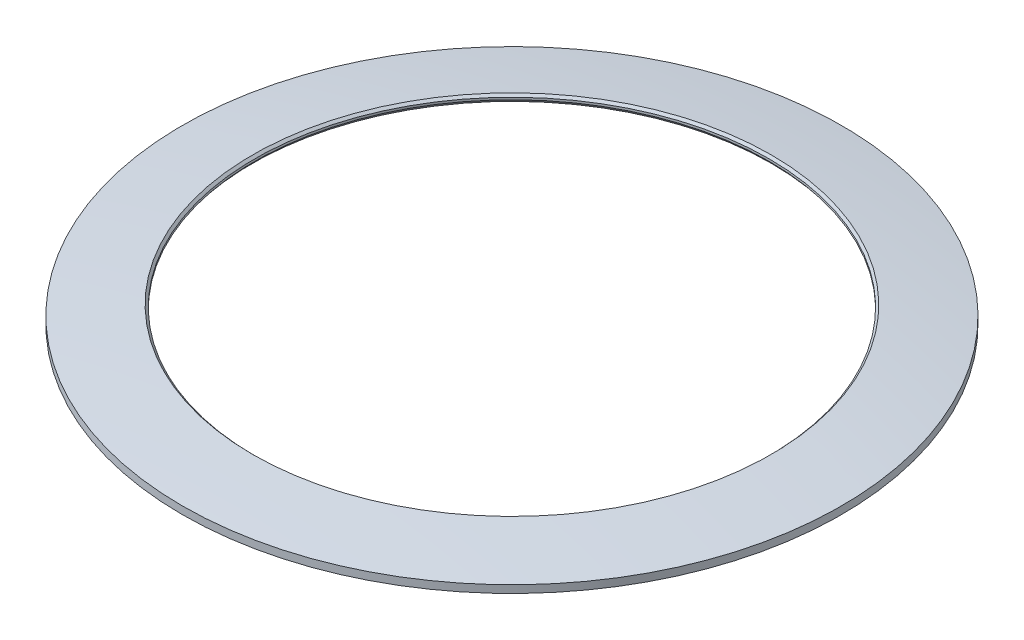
ISO-10303-21;
HEADER;
FILE_DESCRIPTION(('STEP AP214'),'2;1');
FILE_NAME('part.step','',(''),(''),'','','');
FILE_SCHEMA(('AUTOMOTIVE_DESIGN { 1 0 10303 214 1 1 1 1 }'));
ENDSEC;
DATA;
#1=APPLICATION_CONTEXT('core data for automotive mechanical design processes');
#2=APPLICATION_PROTOCOL_DEFINITION('international standard','automotive_design',2000,#1);
#3=PRODUCT_CONTEXT('',#1,'mechanical');
#4=PRODUCT('Part','Part','',(#3));
#5=PRODUCT_RELATED_PRODUCT_CATEGORY('part','',(#4));
#6=PRODUCT_DEFINITION_FORMATION('','',#4);
#7=PRODUCT_DEFINITION_CONTEXT('part definition',#1,'design');
#8=PRODUCT_DEFINITION('design','',#6,#7);
#9=PRODUCT_DEFINITION_SHAPE('','',#8);
#10=(LENGTH_UNIT() NAMED_UNIT(*) SI_UNIT(.MILLI.,.METRE.));
#11=(NAMED_UNIT(*) PLANE_ANGLE_UNIT() SI_UNIT($,.RADIAN.));
#12=(NAMED_UNIT(*) SI_UNIT($,.STERADIAN.) SOLID_ANGLE_UNIT());
#13=UNCERTAINTY_MEASURE_WITH_UNIT(LENGTH_MEASURE(1.E-05),#10,'distance_accuracy_value','');
#14=(GEOMETRIC_REPRESENTATION_CONTEXT(3) GLOBAL_UNCERTAINTY_ASSIGNED_CONTEXT((#13)) GLOBAL_UNIT_ASSIGNED_CONTEXT((#10,
#11,#12)) REPRESENTATION_CONTEXT('',''));
#15=CARTESIAN_POINT('',(0.,0.,0.));
#16=DIRECTION('',(0.,0.,1.));
#17=DIRECTION('',(1.,0.,0.));
#18=AXIS2_PLACEMENT_3D('',#15,#16,#17);
#19=CARTESIAN_POINT('',(2.62298239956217E-13,-355.6,0.));
#20=DIRECTION('',(0.,0.,1.));
#21=DIRECTION('',(-1.,0.,0.));
#22=AXIS2_PLACEMENT_3D('',#19,#20,#21);
#23=ELLIPSE('',#22,711.2,355.6);
#24=TRIMMED_CURVE('',#23,(PARAMETER_VALUE(1.5707963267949)),(PARAMETER_VALUE(4.71238898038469)),
.T.,.PARAMETER.);
#25=CARTESIAN_POINT('',(0.,1786.22766932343,0.));
#26=DIRECTION('',(0.,1.,0.));
#27=AXIS1_PLACEMENT('',#25,#26);
#28=SURFACE_OF_REVOLUTION('',#24,#27);
#29=OFFSET_SURFACE('',#28,4.7625,.F.);
#30=CARTESIAN_POINT('',(0.,-4.8982716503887,0.));
#31=DIRECTION('',(0.,1.,0.));
#32=DIRECTION('',(0.,0.,1.));
#33=AXIS2_PLACEMENT_3D('',#30,#31,#32);
#34=CIRCLE('',#33,164.93214851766);
#35=CARTESIAN_POINT('',(0.,-4.8982716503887,164.93214851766));
#36=VERTEX_POINT('',#35);
#37=EDGE_CURVE('E48',#36,#36,#34,.F.);
#38=ORIENTED_EDGE('',*,*,#37,.T.);
#39=EDGE_LOOP('',(#38));
#40=FACE_BOUND('',#39,.T.);
#41=CARTESIAN_POINT('',(0.,-10.9674415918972,0.));
#42=DIRECTION('',(0.,1.,0.));
#43=DIRECTION('',(0.,0.,1.));
#44=AXIS2_PLACEMENT_3D('',#41,#42,#43);
#45=CIRCLE('',#44,209.55);
#46=CARTESIAN_POINT('',(0.,-10.9674415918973,209.55));
#47=VERTEX_POINT('',#46);
#48=EDGE_CURVE('E53',#47,#47,#45,.F.);
#49=ORIENTED_EDGE('',*,*,#48,.F.);
#50=EDGE_LOOP('',(#49));
#51=FACE_BOUND('',#50,.T.);
#52=ADVANCED_FACE('F33',(#40,#51),#29,.T.);
#53=CARTESIAN_POINT('',(2.62298239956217E-13,-355.6,0.));
#54=DIRECTION('',(0.,0.,1.));
#55=DIRECTION('',(-1.,0.,0.));
#56=AXIS2_PLACEMENT_3D('',#53,#54,#55);
#57=ELLIPSE('',#56,711.2,355.6);
#58=TRIMMED_CURVE('',#57,(PARAMETER_VALUE(1.5707963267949)),(PARAMETER_VALUE(4.71238898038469)),
.T.,.PARAMETER.);
#59=CARTESIAN_POINT('',(0.,1786.22766932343,0.));
#60=DIRECTION('',(0.,1.,0.));
#61=AXIS1_PLACEMENT('',#59,#60);
#62=SURFACE_OF_REVOLUTION('',#58,#61);
#63=CARTESIAN_POINT('',(0.,-9.71317737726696,0.));
#64=DIRECTION('',(0.,1.,0.));
#65=DIRECTION('',(0.,0.,1.));
#66=AXIS2_PLACEMENT_3D('',#63,#64,#65);
#67=CIRCLE('',#66,165.089865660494);
#68=CARTESIAN_POINT('',(0.,-9.71317737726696,165.089865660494));
#69=VERTEX_POINT('',#68);
#70=EDGE_CURVE('E11',#69,#69,#67,.T.);
#71=ORIENTED_EDGE('',*,*,#70,.T.);
#72=EDGE_LOOP('',(#71));
#73=FACE_BOUND('',#72,.T.);
#74=CARTESIAN_POINT('',(0.,-15.785992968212,0.));
#75=DIRECTION('',(0.,1.,0.));
#76=DIRECTION('',(0.,0.,1.));
#77=AXIS2_PLACEMENT_3D('',#74,#75,#76);
#78=CIRCLE('',#77,209.55);
#79=CARTESIAN_POINT('',(0.,-15.7859929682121,209.55));
#80=VERTEX_POINT('',#79);
#81=EDGE_CURVE('E54',#80,#80,#78,.F.);
#82=ORIENTED_EDGE('',*,*,#81,.T.);
#83=EDGE_LOOP('',(#82));
#84=FACE_BOUND('',#83,.T.);
#85=ADVANCED_FACE('F80',(#73,#84),#62,.F.);
#86=CARTESIAN_POINT('',(0.,-309.88,0.));
#87=DIRECTION('',(0.,1.,0.));
#88=DIRECTION('',(0.,0.,1.));
#89=AXIS2_PLACEMENT_3D('',#86,#87,#88);
#90=CYLINDRICAL_SURFACE('',#89,163.5125);
#91=CARTESIAN_POINT('',(0.,-7.71326516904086,0.));
#92=DIRECTION('',(0.,-1.,0.));
#93=DIRECTION('',(0.,0.,-1.));
#94=AXIS2_PLACEMENT_3D('',#91,#92,#93);
#95=CIRCLE('',#94,163.5125);
#96=CARTESIAN_POINT('',(0.,-7.71326516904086,-163.5125));
#97=VERTEX_POINT('',#96);
#98=EDGE_CURVE('E40',#97,#97,#95,.T.);
#99=ORIENTED_EDGE('',*,*,#98,.T.);
#100=EDGE_LOOP('',(#99));
#101=FACE_BOUND('',#100,.T.);
#102=CARTESIAN_POINT('',(0.,-6.31792016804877,0.));
#103=DIRECTION('',(0.,-1.,0.));
#104=DIRECTION('',(0.,0.,-1.));
#105=AXIS2_PLACEMENT_3D('',#102,#103,#104);
#106=CIRCLE('',#105,163.5125);
#107=CARTESIAN_POINT('',(0.,-6.31792016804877,-163.5125));
#108=VERTEX_POINT('',#107);
#109=EDGE_CURVE('E44',#108,#108,#106,.F.);
#110=ORIENTED_EDGE('',*,*,#109,.T.);
#111=EDGE_LOOP('',(#110));
#112=FACE_BOUND('',#111,.T.);
#113=ADVANCED_FACE('F74',(#101,#112),#90,.F.);
#114=CARTESIAN_POINT('',(0.,-355.6,0.));
#115=DIRECTION('',(0.,1.,0.));
#116=DIRECTION('',(0.,0.,1.));
#117=AXIS2_PLACEMENT_3D('',#114,#115,#116);
#118=CYLINDRICAL_SURFACE('',#117,209.55);
#119=CARTESIAN_POINT('',(0.,-15.7859929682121,209.55));
#120=CARTESIAN_POINT('',(0.,-15.7357997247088,209.55));
#121=CARTESIAN_POINT('',(0.,-15.6856064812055,209.55));
#122=CARTESIAN_POINT('',(0.,-15.585219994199,209.55));
#123=CARTESIAN_POINT('',(0.,-15.5350267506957,209.55));
#124=CARTESIAN_POINT('',(0.,-15.4346402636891,209.55));
#125=CARTESIAN_POINT('',(0.,-15.3844470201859,209.55));
#126=CARTESIAN_POINT('',(0.,-15.2840605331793,209.55));
#127=CARTESIAN_POINT('',(0.,-15.233867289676,209.55));
#128=CARTESIAN_POINT('',(0.,-15.1334808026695,209.55));
#129=CARTESIAN_POINT('',(0.,-15.0832875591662,209.55));
#130=CARTESIAN_POINT('',(0.,-14.9829010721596,209.55));
#131=CARTESIAN_POINT('',(0.,-14.9327078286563,209.55));
#132=CARTESIAN_POINT('',(0.,-14.8323213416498,209.55));
#133=CARTESIAN_POINT('',(0.,-14.7821280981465,209.55));
#134=CARTESIAN_POINT('',(0.,-14.68174161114,209.55));
#135=CARTESIAN_POINT('',(0.,-14.6315483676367,209.55));
#136=CARTESIAN_POINT('',(0.,-14.5311618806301,209.55));
#137=CARTESIAN_POINT('',(0.,-14.4809686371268,209.55));
#138=CARTESIAN_POINT('',(0.,-14.3805821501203,209.55));
#139=CARTESIAN_POINT('',(0.,-14.330388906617,209.55));
#140=CARTESIAN_POINT('',(0.,-14.2300024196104,209.55));
#141=CARTESIAN_POINT('',(0.,-14.1798091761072,209.55));
#142=CARTESIAN_POINT('',(0.,-14.0794226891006,209.55));
#143=CARTESIAN_POINT('',(0.,-14.0292294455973,209.55));
#144=CARTESIAN_POINT('',(0.,-13.9288429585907,209.55));
#145=CARTESIAN_POINT('',(0.,-13.8786497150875,209.55));
#146=CARTESIAN_POINT('',(0.,-13.7782632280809,209.55));
#147=CARTESIAN_POINT('',(0.,-13.7280699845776,209.55));
#148=CARTESIAN_POINT('',(0.,-13.6276834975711,209.55));
#149=CARTESIAN_POINT('',(0.,-13.5774902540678,209.55));
#150=CARTESIAN_POINT('',(0.,-13.4771037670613,209.55));
#151=CARTESIAN_POINT('',(0.,-13.426910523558,209.55));
#152=CARTESIAN_POINT('',(0.,-13.3265240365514,209.55));
#153=CARTESIAN_POINT('',(0.,-13.2763307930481,209.55));
#154=CARTESIAN_POINT('',(0.,-13.1759443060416,209.55));
#155=CARTESIAN_POINT('',(0.,-13.1257510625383,209.55));
#156=CARTESIAN_POINT('',(0.,-13.0253645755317,209.55));
#157=CARTESIAN_POINT('',(0.,-12.9751713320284,209.55));
#158=CARTESIAN_POINT('',(0.,-12.8747848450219,209.55));
#159=CARTESIAN_POINT('',(0.,-12.8245916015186,209.55));
#160=CARTESIAN_POINT('',(0.,-12.7242051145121,209.55));
#161=CARTESIAN_POINT('',(0.,-12.6740118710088,209.55));
#162=CARTESIAN_POINT('',(0.,-12.5736253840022,209.55));
#163=CARTESIAN_POINT('',(0.,-12.5234321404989,209.55));
#164=CARTESIAN_POINT('',(0.,-12.4230456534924,209.55));
#165=CARTESIAN_POINT('',(0.,-12.3728524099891,209.55));
#166=CARTESIAN_POINT('',(0.,-12.2724659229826,209.55));
#167=CARTESIAN_POINT('',(0.,-12.2222726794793,209.55));
#168=CARTESIAN_POINT('',(0.,-12.1218861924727,209.55));
#169=CARTESIAN_POINT('',(0.,-12.0716929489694,209.55));
#170=CARTESIAN_POINT('',(0.,-11.9713064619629,209.55));
#171=CARTESIAN_POINT('',(0.,-11.9211132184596,209.55));
#172=CARTESIAN_POINT('',(0.,-11.820726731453,209.55));
#173=CARTESIAN_POINT('',(0.,-11.7705334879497,209.55));
#174=CARTESIAN_POINT('',(0.,-11.6701470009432,209.55));
#175=CARTESIAN_POINT('',(0.,-11.6199537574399,209.55));
#176=CARTESIAN_POINT('',(0.,-11.5195672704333,209.55));
#177=CARTESIAN_POINT('',(0.,-11.4693740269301,209.55));
#178=CARTESIAN_POINT('',(0.,-11.3689875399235,209.55));
#179=CARTESIAN_POINT('',(0.,-11.3187942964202,209.55));
#180=CARTESIAN_POINT('',(0.,-11.2184078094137,209.55));
#181=CARTESIAN_POINT('',(0.,-11.1682145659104,209.55));
#182=CARTESIAN_POINT('',(0.,-11.0678280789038,209.55));
#183=CARTESIAN_POINT('',(0.,-11.0176348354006,209.55));
#184=CARTESIAN_POINT('',(0.,-10.9674415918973,209.55));
#185=B_SPLINE_CURVE_WITH_KNOTS('',3,(#119,#120,#121,#122,#123,#124,#125,#126,#127,#128,#129,
#130,#131,#132,#133,#134,#135,#136,#137,#138,#139,#140,#141,#142,#143,#144,#145,#146,#147,#148,
#149,#150,#151,#152,#153,#154,#155,#156,#157,#158,#159,#160,#161,#162,#163,#164,#165,#166,#167,
#168,#169,#170,#171,#172,#173,#174,#175,#176,#177,#178,#179,#180,#181,#182,#183,#184),
.UNSPECIFIED.,.F.,.F.,(4,2,2,2,2,2,2,2,2,2,2,2,2,2,2,2,2,2,2,2,2,2,2,2,2,2,2,2,2,2,2,2,4),(0.,
0.150579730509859,0.301159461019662,0.451739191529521,0.602318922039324,0.752898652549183,
0.903478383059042,1.05405811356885,1.2046378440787,1.35521757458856,1.50579730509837,
1.65637703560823,1.80695676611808,1.95753649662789,2.10811622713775,2.25869595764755,
2.40927568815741,2.55985541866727,2.71043514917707,2.86101487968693,3.01159461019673,
3.16217434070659,3.31275407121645,3.46333380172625,3.61391353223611,3.76449326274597,
3.91507299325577,4.06565272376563,4.21623245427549,4.3668121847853,4.51739191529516,
4.66797164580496,4.81855137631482),.UNSPECIFIED.);
#186=EDGE_CURVE('BSEAM67',#80,#47,#185,.T.);
#187=ORIENTED_EDGE('',*,*,#81,.F.);
#188=ORIENTED_EDGE('',*,*,#48,.T.);
#189=ORIENTED_EDGE('',*,*,#186,.T.);
#190=ORIENTED_EDGE('',*,*,#186,.F.);
#191=EDGE_LOOP('',(#187,#189,#188,#190));
#192=FACE_BOUND('',#191,.T.);
#193=ADVANCED_FACE('F67',(#192),#118,.T.);
#194=CARTESIAN_POINT('',(0.,-4.8982716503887,0.));
#195=DIRECTION('',(0.,1.,0.));
#196=DIRECTION('',(0.,0.,1.));
#197=AXIS2_PLACEMENT_3D('',#194,#195,#196);
#198=CONICAL_SURFACE('',#197,164.93214851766,0.78539816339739);
#199=ORIENTED_EDGE('',*,*,#109,.F.);
#200=EDGE_LOOP('',(#199));
#201=FACE_BOUND('',#200,.T.);
#202=ORIENTED_EDGE('',*,*,#37,.F.);
#203=EDGE_LOOP('',(#202));
#204=FACE_BOUND('',#203,.T.);
#205=ADVANCED_FACE('F65',(#201,#204),#198,.F.);
#206=CARTESIAN_POINT('',(0.,-7.71326516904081,0.));
#207=DIRECTION('',(0.,-1.,0.));
#208=DIRECTION('',(0.,0.,-1.));
#209=AXIS2_PLACEMENT_3D('',#206,#207,#208);
#210=CONICAL_SURFACE('',#209,163.5125,0.66782337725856);
#211=ORIENTED_EDGE('',*,*,#70,.F.);
#212=EDGE_LOOP('',(#211));
#213=FACE_BOUND('',#212,.T.);
#214=ORIENTED_EDGE('',*,*,#98,.F.);
#215=EDGE_LOOP('',(#214));
#216=FACE_BOUND('',#215,.T.);
#217=ADVANCED_FACE('F35',(#213,#216),#210,.F.);
#218=CLOSED_SHELL('',(#52,#85,#113,#193,#205,#217));
#219=MANIFOLD_SOLID_BREP('B2',#218);
#220=ADVANCED_BREP_SHAPE_REPRESENTATION('',(#18,#219),#14);
#221=SHAPE_DEFINITION_REPRESENTATION(#9,#220);
ENDSEC;
END-ISO-10303-21;
